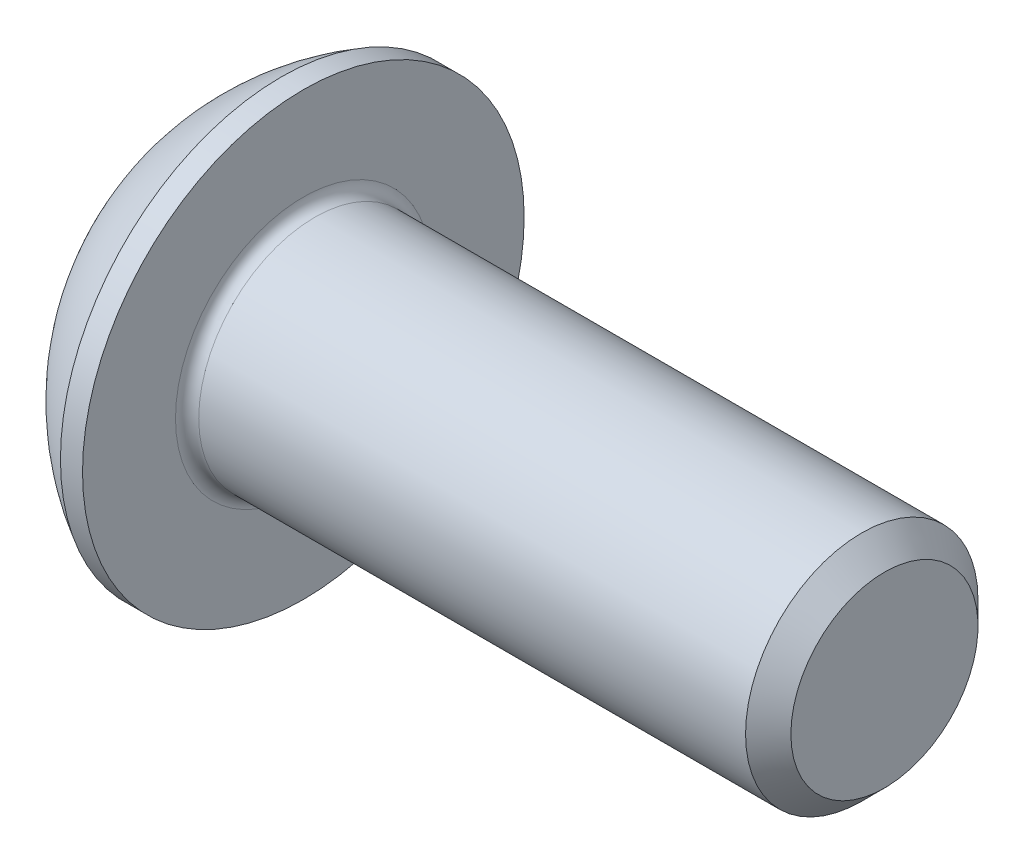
from build123d import *

# Parameters (mm, degrees)
FILLET1_R   = 0.2
HEX_2_DEPTH = 1.3


with BuildPart() as part:
    # BodySke → BaseBody (revolve)
    with BuildSketch(Plane.XY, mode=Mode.PRIVATE) as basebody_sk:
        with BuildLine():
            Line((12.2, 0), (12.2, 1.61))
            Line((12.2, 1.61), (11.81, 2))
            Line((11.81, 2), (2.2, 2))
            Line((2.2, 2), (2.2, 3.8))
            Line((2.2, 3.8), (1.82, 3.8))
            ThreePointArc((1.82, 3.8), (0.762013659, 2.991755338), (0, 1.9))
            Line((0, 1.9), (0, 0))
            Line((0, 0), (12.2, 0))
        make_face()
    revolve(basebody_sk.sketch.rotate(Axis((0, 0, 0), (1, 0, 0)), 90), axis=Axis((0, 0, 0), (1, 0, 0)))

    # Fillet1
    fillet1_edges = [part.edges().sort_by_distance(p)[0] for p in [
        (2.2, 0, -2),
    ]]
    fillet(fillet1_edges, radius=FILLET1_R)

    # Sketch2 → PreBroach (revolve, cut)
    with BuildSketch(Plane.XY, mode=Mode.PRIVATE) as prebroach_sk:
        Polygon((0, 1.25), (1.3, 1.25), (2.021687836, 0), (0, 0), align=None)
    revolve(prebroach_sk.sketch.rotate(Axis((0, 0, 0), (1, 0, 0)), 90), axis=Axis((0, 0, 0), (1, 0, 0)), mode=Mode.SUBTRACT)

    # Sketch3 → Hex 2 (cut)
    with BuildSketch(Plane(origin=(0, 0, 0), x_dir=(0, 0, -1), z_dir=(1, 0, 0))):
        Polygon((-1.25, -0.721687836), (-1.25, 0.721687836), (0, 1.443375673), (1.25, 0.721687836), (1.25, -0.721687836), (0, -1.443375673), align=None)
    extrude(amount=HEX_2_DEPTH, mode=Mode.SUBTRACT)


solid = part.part
